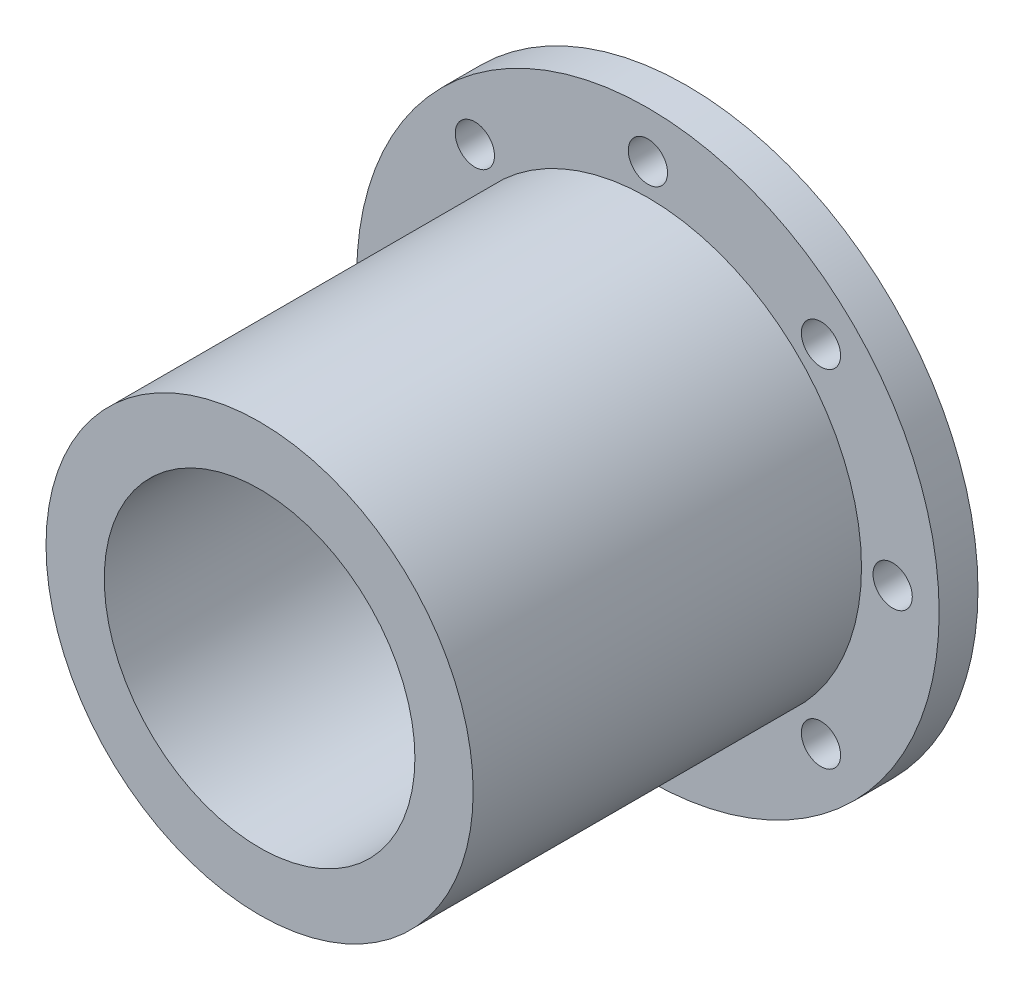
from build123d import *

# Parameters (mm, degrees)
SKETCH1_R           = 55
SKETCH1_R_2         = 40
BOSS_EXTRUDE2_DEPTH = 100
SKETCH2_R           = 75
SKETCH2_R_2         = 55
BOSS_EXTRUDE3_DEPTH = 10
SKETCH4_R           = 5.054534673
CUT_EXTRUDE1_DEPTH  = 10


with BuildPart() as part:
    # Sketch1 → Boss-Extrude2 (new body)
    with BuildSketch(Plane.XY):
        Circle(SKETCH1_R)
        Circle(SKETCH1_R_2, mode=Mode.SUBTRACT)
    extrude(amount=BOSS_EXTRUDE2_DEPTH)


with BuildPart() as body_2:
    # Sketch2 → Boss-Extrude3 (new body)
    with BuildSketch(Plane.XY):
        Circle(SKETCH2_R)
        Circle(SKETCH2_R_2, mode=Mode.SUBTRACT)
    extrude(amount=-BOSS_EXTRUDE3_DEPTH)

    # Sketch4 → Cut-Extrude1 (cut)
    with BuildSketch(Plane.XY):
        with Locations((0, 63.023729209)):
            Circle(SKETCH4_R)
        with Locations((44.564506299, 44.564506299)):
            Circle(SKETCH4_R)
        with Locations((63.023729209, 0)):
            Circle(SKETCH4_R)
        with Locations((44.564506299, -44.564506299)):
            Circle(SKETCH4_R)
        with Locations((0, -63.023729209)):
            Circle(SKETCH4_R)
        with Locations((-44.564506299, -44.564506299)):
            Circle(SKETCH4_R)
        with Locations((-63.023729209, 0)):
            Circle(SKETCH4_R)
        with Locations((-44.564506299, 44.564506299)):
            Circle(SKETCH4_R)
    extrude(amount=-CUT_EXTRUDE1_DEPTH, mode=Mode.SUBTRACT)


solid = Compound([part.part, body_2.part])
